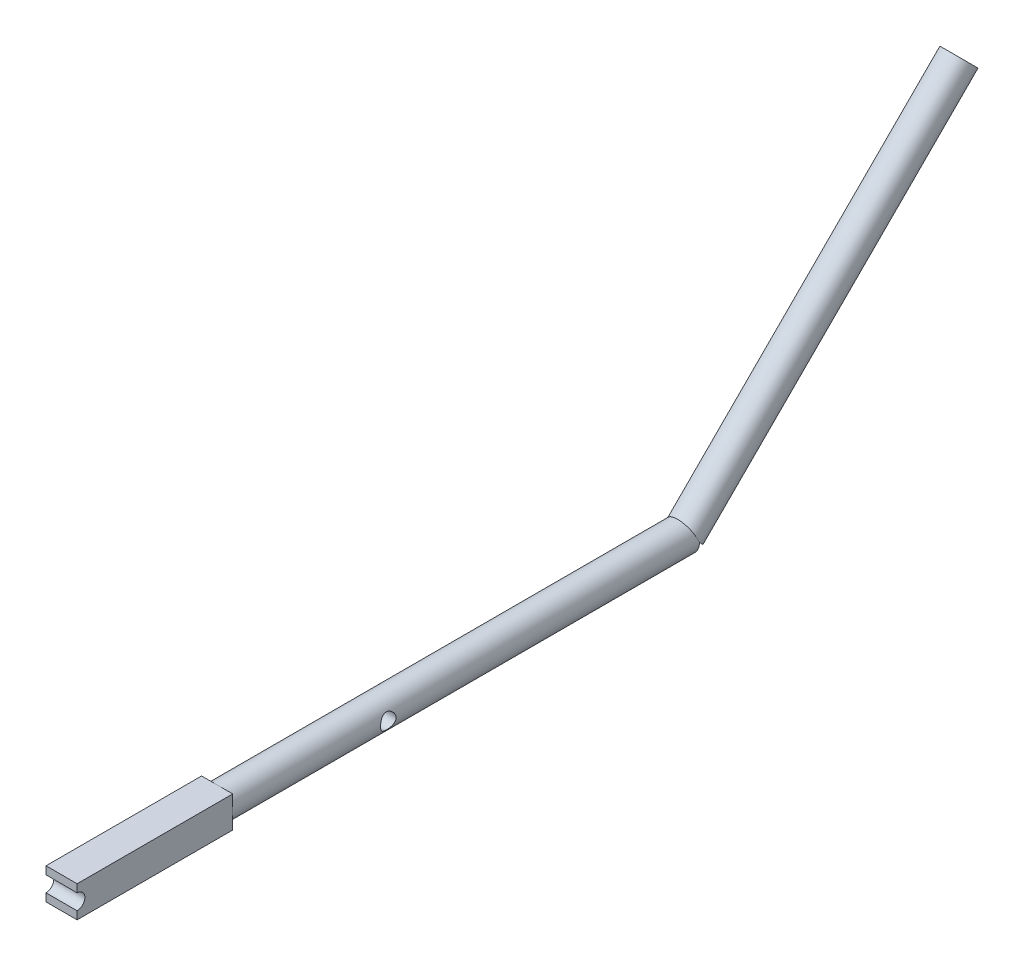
ISO-10303-21;
HEADER;
FILE_DESCRIPTION(('STEP AP214'),'2;1');
FILE_NAME('part.step','',(''),(''),'','','');
FILE_SCHEMA(('AUTOMOTIVE_DESIGN { 1 0 10303 214 1 1 1 1 }'));
ENDSEC;
DATA;
#1=APPLICATION_CONTEXT('core data for automotive mechanical design processes');
#2=APPLICATION_PROTOCOL_DEFINITION('international standard','automotive_design',2000,#1);
#3=PRODUCT_CONTEXT('',#1,'mechanical');
#4=PRODUCT('Part','Part','',(#3));
#5=PRODUCT_RELATED_PRODUCT_CATEGORY('part','',(#4));
#6=PRODUCT_DEFINITION_FORMATION('','',#4);
#7=PRODUCT_DEFINITION_CONTEXT('part definition',#1,'design');
#8=PRODUCT_DEFINITION('design','',#6,#7);
#9=PRODUCT_DEFINITION_SHAPE('','',#8);
#10=(LENGTH_UNIT() NAMED_UNIT(*) SI_UNIT(.MILLI.,.METRE.));
#11=(NAMED_UNIT(*) PLANE_ANGLE_UNIT() SI_UNIT($,.RADIAN.));
#12=(NAMED_UNIT(*) SI_UNIT($,.STERADIAN.) SOLID_ANGLE_UNIT());
#13=UNCERTAINTY_MEASURE_WITH_UNIT(LENGTH_MEASURE(1.E-05),#10,'distance_accuracy_value','');
#14=(GEOMETRIC_REPRESENTATION_CONTEXT(3) GLOBAL_UNCERTAINTY_ASSIGNED_CONTEXT((#13)) GLOBAL_UNIT_ASSIGNED_CONTEXT((#10,
#11,#12)) REPRESENTATION_CONTEXT('',''));
#15=CARTESIAN_POINT('',(0.,0.,0.));
#16=DIRECTION('',(0.,0.,1.));
#17=DIRECTION('',(1.,0.,0.));
#18=AXIS2_PLACEMENT_3D('',#15,#16,#17);
#19=CARTESIAN_POINT('',(0.,0.,400.));
#20=DIRECTION('',(0.,0.,1.));
#21=DIRECTION('',(1.,0.,0.));
#22=AXIS2_PLACEMENT_3D('',#19,#20,#21);
#23=PLANE('',#22);
#24=DIRECTION('',(1.,0.,0.));
#25=VECTOR('',#24,1.);
#26=CARTESIAN_POINT('',(-48.2842712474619,-9.99999999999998,400.));
#27=LINE('',#26,#25);
#28=CARTESIAN_POINT('',(-20.,-9.99999999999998,400.));
#29=VERTEX_POINT('',#28);
#30=CARTESIAN_POINT('',(20.,-9.99999999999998,400.));
#31=VERTEX_POINT('',#30);
#32=EDGE_CURVE('E100',#29,#31,#27,.T.);
#33=ORIENTED_EDGE('',*,*,#32,.F.);
#34=DIRECTION('',(0.,-1.,0.));
#35=VECTOR('',#34,1.);
#36=CARTESIAN_POINT('',(-20.,-20.1185560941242,400.));
#37=LINE('',#36,#35);
#38=CARTESIAN_POINT('',(-20.,-20.1185560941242,400.));
#39=VERTEX_POINT('',#38);
#40=EDGE_CURVE('E326',#29,#39,#37,.T.);
#41=ORIENTED_EDGE('',*,*,#40,.T.);
#42=DIRECTION('',(1.,0.,0.));
#43=VECTOR('',#42,1.);
#44=CARTESIAN_POINT('',(20.,-20.1185560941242,400.));
#45=LINE('',#44,#43);
#46=CARTESIAN_POINT('',(20.,-20.1185560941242,400.));
#47=VERTEX_POINT('',#46);
#48=EDGE_CURVE('E118',#39,#47,#45,.T.);
#49=ORIENTED_EDGE('',*,*,#48,.T.);
#50=DIRECTION('',(0.,1.,0.));
#51=VECTOR('',#50,1.);
#52=CARTESIAN_POINT('',(20.,-20.1185560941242,400.));
#53=LINE('',#52,#51);
#54=EDGE_CURVE('E112',#47,#31,#53,.T.);
#55=ORIENTED_EDGE('',*,*,#54,.T.);
#56=EDGE_LOOP('',(#33,#41,#49,#55));
#57=FACE_BOUND('',#56,.T.);
#58=ADVANCED_FACE('F33',(#57),#23,.T.);
#59=CARTESIAN_POINT('',(0.,0.,-400.));
#60=DIRECTION('',(0.,0.,1.));
#61=DIRECTION('',(1.,0.,0.));
#62=AXIS2_PLACEMENT_3D('',#59,#60,#61);
#63=CYLINDRICAL_SURFACE('',#62,20.);
#64=CARTESIAN_POINT('',(-20.,0.,-10.));
#65=CARTESIAN_POINT('',(-19.9999992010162,-0.26297774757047,-9.99999913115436));
#66=CARTESIAN_POINT('',(-19.9948010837,-0.525973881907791,-9.98961448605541));
#67=CARTESIAN_POINT('',(-19.9741395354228,-1.05002923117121,-9.94819417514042));
#68=CARTESIAN_POINT('',(-19.9586716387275,-1.31108755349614,-9.91714952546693));
#69=CARTESIAN_POINT('',(-19.9178362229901,-1.82963226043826,-9.83470808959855));
#70=CARTESIAN_POINT('',(-19.8924520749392,-2.08711188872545,-9.7832771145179));
#71=CARTESIAN_POINT('',(-19.8324363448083,-2.59618182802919,-9.6606617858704));
#72=CARTESIAN_POINT('',(-19.7978056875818,-2.84777272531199,-9.58947940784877));
#73=CARTESIAN_POINT('',(-19.720303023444,-3.34246836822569,-9.42843099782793));
#74=CARTESIAN_POINT('',(-19.6774637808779,-3.58560245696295,-9.33863913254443));
#75=CARTESIAN_POINT('',(-19.5844658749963,-4.06298432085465,-9.14105567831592));
#76=CARTESIAN_POINT('',(-19.5343070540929,-4.29723190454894,-9.03326370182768));
#77=CARTESIAN_POINT('',(-19.4278257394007,-4.75551398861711,-8.80063076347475));
#78=CARTESIAN_POINT('',(-19.371505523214,-4.97955221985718,-8.67579609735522));
#79=CARTESIAN_POINT('',(-19.2538936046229,-5.41653080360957,-8.40991307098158));
#80=CARTESIAN_POINT('',(-19.1925999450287,-5.62946673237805,-8.2688583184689));
#81=CARTESIAN_POINT('',(-19.0625536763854,-6.0557115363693,-7.96249543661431));
#82=CARTESIAN_POINT('',(-18.9935741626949,-6.2682689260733,-7.7962377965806));
#83=CARTESIAN_POINT('',(-18.8531326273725,-6.67880739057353,-7.4475548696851));
#84=CARTESIAN_POINT('',(-18.7816704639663,-6.87678763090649,-7.26512865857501));
#85=CARTESIAN_POINT('',(-18.6379106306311,-7.25738906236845,-6.88496142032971));
#86=CARTESIAN_POINT('',(-18.5656124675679,-7.44000060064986,-6.68721091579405));
#87=CARTESIAN_POINT('',(-18.4219676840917,-7.7888836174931,-6.27739804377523));
#88=CARTESIAN_POINT('',(-18.3506212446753,-7.95515202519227,-6.06533299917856));
#89=CARTESIAN_POINT('',(-18.2052535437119,-8.2827111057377,-5.61080680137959));
#90=CARTESIAN_POINT('',(-18.1314567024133,-8.44260565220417,-5.3672646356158));
#91=CARTESIAN_POINT('',(-17.9894590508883,-8.74109142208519,-4.8660415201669));
#92=CARTESIAN_POINT('',(-17.9212558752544,-8.87969167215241,-4.60836662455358));
#93=CARTESIAN_POINT('',(-17.7927881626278,-9.13438777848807,-4.08030079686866));
#94=CARTESIAN_POINT('',(-17.7325212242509,-9.25049044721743,-3.8099137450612));
#95=CARTESIAN_POINT('',(-17.6222099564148,-9.45894522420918,-3.25811404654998));
#96=CARTESIAN_POINT('',(-17.5721644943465,-9.55129996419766,-2.97670262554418));
#97=CARTESIAN_POINT('',(-17.4870229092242,-9.70625458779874,-2.42208495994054));
#98=CARTESIAN_POINT('',(-17.4512120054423,-9.77030307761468,-2.14939374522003));
#99=CARTESIAN_POINT('',(-17.3919377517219,-9.87543221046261,-1.59828353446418));
#100=CARTESIAN_POINT('',(-17.368473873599,-9.91651383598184,-1.31986478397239));
#101=CARTESIAN_POINT('',(-17.3349233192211,-9.97504777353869,-0.7599854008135));
#102=CARTESIAN_POINT('',(-17.3248253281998,-9.99252007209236,-0.478527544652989));
#103=CARTESIAN_POINT('',(-17.3184259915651,-10.0036080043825,0.0850025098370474));
#104=CARTESIAN_POINT('',(-17.3221233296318,-9.99722591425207,0.367074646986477));
#105=CARTESIAN_POINT('',(-17.3418743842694,-9.96291632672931,0.895404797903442));
#106=CARTESIAN_POINT('',(-17.3563927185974,-9.93766509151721,1.14190017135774));
#107=CARTESIAN_POINT('',(-17.3954780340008,-9.8690882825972,1.63163922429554));
#108=CARTESIAN_POINT('',(-17.4200483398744,-9.82575672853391,1.8748818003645));
#109=CARTESIAN_POINT('',(-17.4784283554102,-9.72152759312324,2.35639172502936));
#110=CARTESIAN_POINT('',(-17.5122368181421,-9.66063238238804,2.59465974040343));
#111=CARTESIAN_POINT('',(-17.5880654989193,-9.5218798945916,3.06495356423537));
#112=CARTESIAN_POINT('',(-17.6300889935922,-9.44401584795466,3.29697683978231));
#113=CARTESIAN_POINT('',(-17.7221768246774,-9.27007793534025,3.75871059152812));
#114=CARTESIAN_POINT('',(-17.7724029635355,-9.17362860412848,3.98824705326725));
#115=CARTESIAN_POINT('',(-17.878810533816,-8.96447979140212,4.43843816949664));
#116=CARTESIAN_POINT('',(-17.9349939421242,-8.85177491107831,4.65908984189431));
#117=CARTESIAN_POINT('',(-18.0518884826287,-8.61087933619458,5.09056177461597));
#118=CARTESIAN_POINT('',(-18.1126004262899,-8.48268586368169,5.30138026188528));
#119=CARTESIAN_POINT('',(-18.2371218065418,-8.21155546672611,5.71235236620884));
#120=CARTESIAN_POINT('',(-18.3009314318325,-8.06861764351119,5.9125053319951));
#121=CARTESIAN_POINT('',(-18.4384710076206,-7.74962298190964,6.32613167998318));
#122=CARTESIAN_POINT('',(-18.5124312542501,-7.57166567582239,6.53806610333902));
#123=CARTESIAN_POINT('',(-18.6605447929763,-7.19890817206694,6.9463748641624));
#124=CARTESIAN_POINT('',(-18.7346980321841,-7.00411219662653,7.14275307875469));
#125=CARTESIAN_POINT('',(-18.8814062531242,-6.5984132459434,7.51914658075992));
#126=CARTESIAN_POINT('',(-18.9539598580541,-6.38749704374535,7.69914815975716));
#127=CARTESIAN_POINT('',(-19.0955673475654,-5.95079617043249,8.04145286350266));
#128=CARTESIAN_POINT('',(-19.164622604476,-5.72501741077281,8.20376295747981));
#129=CARTESIAN_POINT('',(-19.3006480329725,-5.24872768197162,8.51679586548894));
#130=CARTESIAN_POINT('',(-19.3673693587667,-4.99755374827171,8.66662084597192));
#131=CARTESIAN_POINT('',(-19.4932401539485,-4.48152997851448,8.94436923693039));
#132=CARTESIAN_POINT('',(-19.5523892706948,-4.21667950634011,9.07229162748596));
#133=CARTESIAN_POINT('',(-19.6613492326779,-3.67526022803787,9.30479430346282));
#134=CARTESIAN_POINT('',(-19.7111660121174,-3.39869900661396,9.40938943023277));
#135=CARTESIAN_POINT('',(-19.7999810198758,-2.83582264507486,9.59405077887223));
#136=CARTESIAN_POINT('',(-19.8389804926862,-2.54950863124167,9.6741198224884));
#137=CARTESIAN_POINT('',(-19.9021913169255,-1.9936008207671,9.80306586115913));
#138=CARTESIAN_POINT('',(-19.9273600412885,-1.72458658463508,9.85397724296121));
#139=CARTESIAN_POINT('',(-19.9668602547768,-1.18250594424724,9.93361515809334));
#140=CARTESIAN_POINT('',(-19.9811923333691,-0.909439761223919,9.96234289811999));
#141=CARTESIAN_POINT('',(-19.9986076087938,-0.361621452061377,9.99722632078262));
#142=CARTESIAN_POINT('',(-20.0016953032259,-0.0868700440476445,10.0033910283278));
#143=CARTESIAN_POINT('',(-19.996544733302,0.462095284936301,9.99308881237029));
#144=CARTESIAN_POINT('',(-19.9883069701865,0.736309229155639,9.97662289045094));
#145=CARTESIAN_POINT('',(-19.9618171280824,1.26069578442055,9.92343793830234));
#146=CARTESIAN_POINT('',(-19.9443921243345,1.51108216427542,9.88839042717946));
#147=CARTESIAN_POINT('',(-19.9005341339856,2.0077033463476,9.79963000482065));
#148=CARTESIAN_POINT('',(-19.8741017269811,2.25393841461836,9.74591829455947));
#149=CARTESIAN_POINT('',(-19.812845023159,2.7406844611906,9.62038600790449));
#150=CARTESIAN_POINT('',(-19.7780202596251,2.98119512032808,9.54856442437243));
#151=CARTESIAN_POINT('',(-19.7007681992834,3.4550508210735,9.38750534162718));
#152=CARTESIAN_POINT('',(-19.6583405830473,3.68839556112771,9.29826711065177));
#153=CARTESIAN_POINT('',(-19.5655046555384,4.15316088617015,9.1003752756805));
#154=CARTESIAN_POINT('',(-19.5149041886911,4.38433936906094,8.99124296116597));
#155=CARTESIAN_POINT('',(-19.4077573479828,4.83663774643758,8.75625210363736));
#156=CARTESIAN_POINT('',(-19.3512088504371,5.05775400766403,8.63038758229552));
#157=CARTESIAN_POINT('',(-19.1744474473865,5.70436813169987,8.22905651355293));
#158=CARTESIAN_POINT('',(-19.0470672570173,6.11337858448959,7.92974633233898));
#159=CARTESIAN_POINT('',(-18.7707873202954,6.91779518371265,7.24229945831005));
#160=CARTESIAN_POINT('',(-18.6210027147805,7.30792110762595,6.84832629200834));
#161=CARTESIAN_POINT('',(-18.3999640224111,7.84082560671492,6.21273944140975));
#162=CARTESIAN_POINT('',(-18.3268393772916,8.00984942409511,5.99326478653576));
#163=CARTESIAN_POINT('',(-18.183737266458,8.32960568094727,5.54026055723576));
#164=CARTESIAN_POINT('',(-18.1137602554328,8.4803354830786,5.30672896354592));
#165=CARTESIAN_POINT('',(-17.9757225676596,8.76928163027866,4.81507400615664));
#166=CARTESIAN_POINT('',(-17.9079221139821,8.90652817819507,4.55630669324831));
#167=CARTESIAN_POINT('',(-17.7804404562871,9.15837639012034,4.02618845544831));
#168=CARTESIAN_POINT('',(-17.7207553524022,9.27298894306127,3.75484365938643));
#169=CARTESIAN_POINT('',(-17.6118078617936,9.47827705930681,3.20145013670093));
#170=CARTESIAN_POINT('',(-17.5625371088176,9.56897185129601,2.91941021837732));
#171=CARTESIAN_POINT('',(-17.4764560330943,9.72530086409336,2.34661678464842));
#172=CARTESIAN_POINT('',(-17.4396437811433,9.79093896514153,2.0558646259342));
#173=CARTESIAN_POINT('',(-17.3830260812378,9.89107565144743,1.49647520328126));
#174=CARTESIAN_POINT('',(-17.3619273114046,9.92795857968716,1.22839424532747));
#175=CARTESIAN_POINT('',(-17.332136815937,9.97987692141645,0.689439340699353));
#176=CARTESIAN_POINT('',(-17.3234442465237,9.99491382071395,0.418565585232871));
#177=CARTESIAN_POINT('',(-17.3188284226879,10.0029096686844,-0.123513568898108));
#178=CARTESIAN_POINT('',(-17.3229004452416,9.9958767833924,-0.394718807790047));
#179=CARTESIAN_POINT('',(-17.3436339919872,9.95985898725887,-0.935172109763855));
#180=CARTESIAN_POINT('',(-17.3602950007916,9.93087497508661,-1.20442025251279));
#181=CARTESIAN_POINT('',(-17.4033551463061,9.85519722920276,-1.71311444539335));
#182=CARTESIAN_POINT('',(-17.4286705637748,9.81046230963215,-1.95294800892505));
#183=CARTESIAN_POINT('',(-17.4882355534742,9.70388285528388,-2.42772919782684));
#184=CARTESIAN_POINT('',(-17.5224880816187,9.6420326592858,-2.66267517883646));
#185=CARTESIAN_POINT('',(-17.5988921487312,9.50186064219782,-3.12622361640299));
#186=CARTESIAN_POINT('',(-17.6410423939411,9.42354151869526,-3.35482710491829));
#187=CARTESIAN_POINT('',(-17.7320944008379,9.25107208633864,-3.80469848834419));
#188=CARTESIAN_POINT('',(-17.7809991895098,9.15691467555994,-4.02596303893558));
#189=CARTESIAN_POINT('',(-17.8877520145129,8.94668289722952,-4.47462589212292));
#190=CARTESIAN_POINT('',(-17.9459794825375,8.82956366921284,-4.70144417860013));
#191=CARTESIAN_POINT('',(-18.067122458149,8.57895403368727,-5.14454543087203));
#192=CARTESIAN_POINT('',(-18.130038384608,8.44546216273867,-5.36082745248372));
#193=CARTESIAN_POINT('',(-18.2590224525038,8.16285657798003,-5.78205137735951));
#194=CARTESIAN_POINT('',(-18.3250916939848,8.0137373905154,-5.98698926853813));
#195=CARTESIAN_POINT('',(-18.4588439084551,7.70065351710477,-6.38466859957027));
#196=CARTESIAN_POINT('',(-18.5265271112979,7.53668670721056,-6.57740828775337));
#197=CARTESIAN_POINT('',(-18.6702735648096,7.17380336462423,-6.9725890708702));
#198=CARTESIAN_POINT('',(-18.746353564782,6.97306234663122,-7.17335317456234));
#199=CARTESIAN_POINT('',(-18.8966226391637,6.55492133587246,-7.55735140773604));
#200=CARTESIAN_POINT('',(-18.9708122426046,6.33752607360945,-7.74059048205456));
#201=CARTESIAN_POINT('',(-19.1154396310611,5.88693376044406,-8.08857822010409));
#202=CARTESIAN_POINT('',(-19.1858744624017,5.65372458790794,-8.25331243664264));
#203=CARTESIAN_POINT('',(-19.3210638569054,5.1728954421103,-8.56287912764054));
#204=CARTESIAN_POINT('',(-19.3858187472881,4.92527630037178,-8.70771274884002));
#205=CARTESIAN_POINT('',(-19.5083417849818,4.41518835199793,-8.97718827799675));
#206=CARTESIAN_POINT('',(-19.5660555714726,4.15262447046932,-9.10167533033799));
#207=CARTESIAN_POINT('',(-19.6722841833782,3.61607511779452,-9.32784736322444));
#208=CARTESIAN_POINT('',(-19.7208001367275,3.34209105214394,-9.42953513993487));
#209=CARTESIAN_POINT('',(-19.8070877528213,2.78539452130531,-9.60868749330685));
#210=CARTESIAN_POINT('',(-19.8448847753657,2.50270444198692,-9.68620928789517));
#211=CARTESIAN_POINT('',(-19.908692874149,1.93047321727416,-9.81627609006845));
#212=CARTESIAN_POINT('',(-19.9347111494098,1.64093637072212,-9.86883635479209));
#213=CARTESIAN_POINT('',(-19.9695276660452,1.12608352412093,-9.93894890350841));
#214=CARTESIAN_POINT('',(-19.9809348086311,0.901651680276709,-9.96182346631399));
#215=CARTESIAN_POINT('',(-19.9961714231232,0.451484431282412,-9.99234959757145));
#216=CARTESIAN_POINT('',(-20.0000006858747,0.225748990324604,-10.0000007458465));
#217=CARTESIAN_POINT('',(-20.,0.,-10.));
#218=B_SPLINE_CURVE_WITH_KNOTS('',3,(#64,#65,#66,#67,#68,#69,#70,#71,#72,#73,#74,#75,#76,#77,
#78,#79,#80,#81,#82,#83,#84,#85,#86,#87,#88,#89,#90,#91,#92,#93,#94,#95,#96,#97,#98,#99,#100,
#101,#102,#103,#104,#105,#106,#107,#108,#109,#110,#111,#112,#113,#114,#115,#116,#117,#118,#119,
#120,#121,#122,#123,#124,#125,#126,#127,#128,#129,#130,#131,#132,#133,#134,#135,#136,#137,#138,
#139,#140,#141,#142,#143,#144,#145,#146,#147,#148,#149,#150,#151,#152,#153,#154,#155,#156,#157,
#158,#159,#160,#161,#162,#163,#164,#165,#166,#167,#168,#169,#170,#171,#172,#173,#174,#175,#176,
#177,#178,#179,#180,#181,#182,#183,#184,#185,#186,#187,#188,#189,#190,#191,#192,#193,#194,#195,
#196,#197,#198,#199,#200,#201,#202,#203,#204,#205,#206,#207,#208,#209,#210,#211,#212,#213,#214,
#215,#216,#217),.UNSPECIFIED.,.T.,.F.,(4,2,2,2,2,2,2,2,2,2,2,2,2,2,2,2,2,2,2,2,2,2,2,2,2,2,2,2,
2,2,2,2,2,2,2,2,2,2,2,2,2,2,2,2,2,2,2,2,2,2,2,2,2,2,2,2,2,2,2,2,2,2,2,2,2,2,2,2,2,2,2,2,2,2,2,2,
4),(0.,0.788710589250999,1.57776436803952,2.36814706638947,3.15845073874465,3.94566328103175,
4.73289277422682,5.51983223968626,6.30708290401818,7.14179607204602,7.9765569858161,
8.81183834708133,9.64727635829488,10.5477781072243,11.447897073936,12.3477430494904,
13.2474892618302,14.0934532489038,14.9393810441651,15.7845922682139,16.6297228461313,
17.3734776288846,18.1174786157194,18.8613792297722,19.6055771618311,20.3667813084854,
21.1282388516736,21.889833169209,22.6514739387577,23.509891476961,24.3680943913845,
25.2270091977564,26.0855844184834,26.9843425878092,27.8831425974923,28.781369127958,
29.6794922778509,30.5032194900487,31.3269018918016,32.1502547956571,32.9735712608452,
33.7329722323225,34.4923243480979,35.2517187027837,36.0111449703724,36.7921013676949,
37.5733375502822,39.1349970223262,40.850013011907,41.7087612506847,42.5676331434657,
43.4684238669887,44.3687801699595,45.2684104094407,46.167901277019,46.9810473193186,
47.7941380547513,48.6069279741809,49.4196846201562,50.1547113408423,50.889981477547,
51.6251312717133,52.3606115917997,53.1452977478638,53.9300540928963,54.7150862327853,
55.5002308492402,56.3809909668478,57.2615018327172,58.1426954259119,59.0238382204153,
59.9114030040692,60.7988588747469,61.6841972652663,62.5689938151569,63.2460309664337,
63.9230868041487),.UNSPECIFIED.);
#219=CARTESIAN_POINT('',(-20.,0.,-10.));
#220=VERTEX_POINT('',#219);
#221=EDGE_CURVE('E11',#220,#220,#218,.T.);
#222=ORIENTED_EDGE('',*,*,#221,.F.);
#223=EDGE_LOOP('',(#222));
#224=FACE_BOUND('',#223,.T.);
#225=CARTESIAN_POINT('',(20.,0.,-10.));
#226=CARTESIAN_POINT('',(19.9999992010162,0.26297774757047,-9.99999913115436));
#227=CARTESIAN_POINT('',(19.9948010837,0.525973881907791,-9.98961448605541));
#228=CARTESIAN_POINT('',(19.9741395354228,1.05002923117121,-9.94819417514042));
#229=CARTESIAN_POINT('',(19.9586716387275,1.31108755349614,-9.91714952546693));
#230=CARTESIAN_POINT('',(19.9178362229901,1.82963226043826,-9.83470808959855));
#231=CARTESIAN_POINT('',(19.8924520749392,2.08711188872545,-9.7832771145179));
#232=CARTESIAN_POINT('',(19.8324363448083,2.59618182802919,-9.6606617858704));
#233=CARTESIAN_POINT('',(19.7978056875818,2.84777272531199,-9.58947940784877));
#234=CARTESIAN_POINT('',(19.720303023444,3.34246836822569,-9.42843099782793));
#235=CARTESIAN_POINT('',(19.6774637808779,3.58560245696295,-9.33863913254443));
#236=CARTESIAN_POINT('',(19.5844658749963,4.06298432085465,-9.14105567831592));
#237=CARTESIAN_POINT('',(19.5343070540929,4.29723190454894,-9.03326370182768));
#238=CARTESIAN_POINT('',(19.4278257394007,4.75551398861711,-8.80063076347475));
#239=CARTESIAN_POINT('',(19.371505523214,4.97955221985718,-8.67579609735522));
#240=CARTESIAN_POINT('',(19.2538936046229,5.41653080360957,-8.40991307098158));
#241=CARTESIAN_POINT('',(19.1925999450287,5.62946673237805,-8.2688583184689));
#242=CARTESIAN_POINT('',(19.0625536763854,6.0557115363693,-7.96249543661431));
#243=CARTESIAN_POINT('',(18.9935741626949,6.2682689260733,-7.7962377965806));
#244=CARTESIAN_POINT('',(18.8531326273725,6.67880739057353,-7.4475548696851));
#245=CARTESIAN_POINT('',(18.7816704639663,6.87678763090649,-7.26512865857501));
#246=CARTESIAN_POINT('',(18.6379106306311,7.25738906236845,-6.88496142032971));
#247=CARTESIAN_POINT('',(18.5656124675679,7.44000060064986,-6.68721091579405));
#248=CARTESIAN_POINT('',(18.4219676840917,7.7888836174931,-6.27739804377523));
#249=CARTESIAN_POINT('',(18.3506212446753,7.95515202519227,-6.06533299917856));
#250=CARTESIAN_POINT('',(18.2052535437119,8.2827111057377,-5.61080680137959));
#251=CARTESIAN_POINT('',(18.1314567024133,8.44260565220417,-5.3672646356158));
#252=CARTESIAN_POINT('',(17.9894590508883,8.74109142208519,-4.8660415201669));
#253=CARTESIAN_POINT('',(17.9212558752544,8.87969167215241,-4.60836662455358));
#254=CARTESIAN_POINT('',(17.7927881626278,9.13438777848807,-4.08030079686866));
#255=CARTESIAN_POINT('',(17.7325212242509,9.25049044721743,-3.8099137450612));
#256=CARTESIAN_POINT('',(17.6222099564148,9.45894522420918,-3.25811404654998));
#257=CARTESIAN_POINT('',(17.5721644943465,9.55129996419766,-2.97670262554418));
#258=CARTESIAN_POINT('',(17.4870229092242,9.70625458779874,-2.42208495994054));
#259=CARTESIAN_POINT('',(17.4512120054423,9.77030307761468,-2.14939374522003));
#260=CARTESIAN_POINT('',(17.3919377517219,9.87543221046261,-1.59828353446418));
#261=CARTESIAN_POINT('',(17.368473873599,9.91651383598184,-1.31986478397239));
#262=CARTESIAN_POINT('',(17.3349233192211,9.97504777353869,-0.7599854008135));
#263=CARTESIAN_POINT('',(17.3248253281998,9.99252007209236,-0.478527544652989));
#264=CARTESIAN_POINT('',(17.3184259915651,10.0036080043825,0.0850025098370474));
#265=CARTESIAN_POINT('',(17.3221233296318,9.99722591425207,0.367074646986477));
#266=CARTESIAN_POINT('',(17.3418743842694,9.96291632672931,0.895404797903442));
#267=CARTESIAN_POINT('',(17.3563927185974,9.93766509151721,1.14190017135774));
#268=CARTESIAN_POINT('',(17.3954780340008,9.8690882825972,1.63163922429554));
#269=CARTESIAN_POINT('',(17.4200483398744,9.82575672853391,1.8748818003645));
#270=CARTESIAN_POINT('',(17.4784283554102,9.72152759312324,2.35639172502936));
#271=CARTESIAN_POINT('',(17.5122368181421,9.66063238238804,2.59465974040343));
#272=CARTESIAN_POINT('',(17.5880654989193,9.5218798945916,3.06495356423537));
#273=CARTESIAN_POINT('',(17.6300889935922,9.44401584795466,3.29697683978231));
#274=CARTESIAN_POINT('',(17.7221768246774,9.27007793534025,3.75871059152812));
#275=CARTESIAN_POINT('',(17.7724029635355,9.17362860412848,3.98824705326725));
#276=CARTESIAN_POINT('',(17.878810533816,8.96447979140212,4.43843816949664));
#277=CARTESIAN_POINT('',(17.9349939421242,8.85177491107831,4.65908984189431));
#278=CARTESIAN_POINT('',(18.0518884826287,8.61087933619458,5.09056177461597));
#279=CARTESIAN_POINT('',(18.1126004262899,8.48268586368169,5.30138026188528));
#280=CARTESIAN_POINT('',(18.2371218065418,8.21155546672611,5.71235236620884));
#281=CARTESIAN_POINT('',(18.3009314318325,8.06861764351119,5.9125053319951));
#282=CARTESIAN_POINT('',(18.4384710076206,7.74962298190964,6.32613167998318));
#283=CARTESIAN_POINT('',(18.5124312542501,7.57166567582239,6.53806610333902));
#284=CARTESIAN_POINT('',(18.6605447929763,7.19890817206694,6.9463748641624));
#285=CARTESIAN_POINT('',(18.7346980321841,7.00411219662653,7.14275307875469));
#286=CARTESIAN_POINT('',(18.8814062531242,6.5984132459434,7.51914658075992));
#287=CARTESIAN_POINT('',(18.9539598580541,6.38749704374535,7.69914815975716));
#288=CARTESIAN_POINT('',(19.0955673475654,5.95079617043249,8.04145286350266));
#289=CARTESIAN_POINT('',(19.164622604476,5.72501741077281,8.20376295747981));
#290=CARTESIAN_POINT('',(19.3006480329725,5.24872768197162,8.51679586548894));
#291=CARTESIAN_POINT('',(19.3673693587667,4.99755374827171,8.66662084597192));
#292=CARTESIAN_POINT('',(19.4932401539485,4.48152997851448,8.94436923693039));
#293=CARTESIAN_POINT('',(19.5523892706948,4.21667950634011,9.07229162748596));
#294=CARTESIAN_POINT('',(19.6613492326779,3.67526022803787,9.30479430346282));
#295=CARTESIAN_POINT('',(19.7111660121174,3.39869900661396,9.40938943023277));
#296=CARTESIAN_POINT('',(19.7999810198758,2.83582264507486,9.59405077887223));
#297=CARTESIAN_POINT('',(19.8389804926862,2.54950863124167,9.6741198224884));
#298=CARTESIAN_POINT('',(19.9021913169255,1.9936008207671,9.80306586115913));
#299=CARTESIAN_POINT('',(19.9273600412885,1.72458658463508,9.85397724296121));
#300=CARTESIAN_POINT('',(19.9668602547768,1.18250594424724,9.93361515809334));
#301=CARTESIAN_POINT('',(19.9811923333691,0.909439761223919,9.96234289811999));
#302=CARTESIAN_POINT('',(19.9986076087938,0.361621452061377,9.99722632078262));
#303=CARTESIAN_POINT('',(20.0016953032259,0.0868700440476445,10.0033910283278));
#304=CARTESIAN_POINT('',(19.996544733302,-0.462095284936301,9.99308881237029));
#305=CARTESIAN_POINT('',(19.9883069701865,-0.736309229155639,9.97662289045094));
#306=CARTESIAN_POINT('',(19.9618171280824,-1.26069578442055,9.92343793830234));
#307=CARTESIAN_POINT('',(19.9443921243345,-1.51108216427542,9.88839042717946));
#308=CARTESIAN_POINT('',(19.9005341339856,-2.0077033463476,9.79963000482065));
#309=CARTESIAN_POINT('',(19.8741017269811,-2.25393841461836,9.74591829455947));
#310=CARTESIAN_POINT('',(19.812845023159,-2.7406844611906,9.62038600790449));
#311=CARTESIAN_POINT('',(19.7780202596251,-2.98119512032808,9.54856442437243));
#312=CARTESIAN_POINT('',(19.7007681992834,-3.4550508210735,9.38750534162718));
#313=CARTESIAN_POINT('',(19.6583405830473,-3.68839556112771,9.29826711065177));
#314=CARTESIAN_POINT('',(19.5655046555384,-4.15316088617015,9.1003752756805));
#315=CARTESIAN_POINT('',(19.5149041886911,-4.38433936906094,8.99124296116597));
#316=CARTESIAN_POINT('',(19.4077573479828,-4.83663774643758,8.75625210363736));
#317=CARTESIAN_POINT('',(19.3512088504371,-5.05775400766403,8.63038758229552));
#318=CARTESIAN_POINT('',(19.1744474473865,-5.70436813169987,8.22905651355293));
#319=CARTESIAN_POINT('',(19.0470672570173,-6.11337858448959,7.92974633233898));
#320=CARTESIAN_POINT('',(18.7707873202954,-6.91779518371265,7.24229945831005));
#321=CARTESIAN_POINT('',(18.6210027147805,-7.30792110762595,6.84832629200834));
#322=CARTESIAN_POINT('',(18.3999640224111,-7.84082560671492,6.21273944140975));
#323=CARTESIAN_POINT('',(18.3268393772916,-8.00984942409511,5.99326478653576));
#324=CARTESIAN_POINT('',(18.183737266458,-8.32960568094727,5.54026055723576));
#325=CARTESIAN_POINT('',(18.1137602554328,-8.4803354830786,5.30672896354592));
#326=CARTESIAN_POINT('',(17.9757225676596,-8.76928163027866,4.81507400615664));
#327=CARTESIAN_POINT('',(17.9079221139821,-8.90652817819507,4.55630669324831));
#328=CARTESIAN_POINT('',(17.7804404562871,-9.15837639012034,4.02618845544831));
#329=CARTESIAN_POINT('',(17.7207553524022,-9.27298894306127,3.75484365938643));
#330=CARTESIAN_POINT('',(17.6118078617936,-9.47827705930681,3.20145013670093));
#331=CARTESIAN_POINT('',(17.5625371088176,-9.56897185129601,2.91941021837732));
#332=CARTESIAN_POINT('',(17.4764560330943,-9.72530086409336,2.34661678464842));
#333=CARTESIAN_POINT('',(17.4396437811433,-9.79093896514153,2.0558646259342));
#334=CARTESIAN_POINT('',(17.3830260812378,-9.89107565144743,1.49647520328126));
#335=CARTESIAN_POINT('',(17.3619273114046,-9.92795857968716,1.22839424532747));
#336=CARTESIAN_POINT('',(17.332136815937,-9.97987692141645,0.689439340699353));
#337=CARTESIAN_POINT('',(17.3234442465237,-9.99491382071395,0.418565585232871));
#338=CARTESIAN_POINT('',(17.3188284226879,-10.0029096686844,-0.123513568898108));
#339=CARTESIAN_POINT('',(17.3229004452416,-9.9958767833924,-0.394718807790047));
#340=CARTESIAN_POINT('',(17.3436339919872,-9.95985898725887,-0.935172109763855));
#341=CARTESIAN_POINT('',(17.3602950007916,-9.93087497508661,-1.20442025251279));
#342=CARTESIAN_POINT('',(17.4033551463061,-9.85519722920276,-1.71311444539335));
#343=CARTESIAN_POINT('',(17.4286705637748,-9.81046230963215,-1.95294800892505));
#344=CARTESIAN_POINT('',(17.4882355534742,-9.70388285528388,-2.42772919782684));
#345=CARTESIAN_POINT('',(17.5224880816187,-9.6420326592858,-2.66267517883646));
#346=CARTESIAN_POINT('',(17.5988921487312,-9.50186064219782,-3.12622361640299));
#347=CARTESIAN_POINT('',(17.6410423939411,-9.42354151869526,-3.35482710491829));
#348=CARTESIAN_POINT('',(17.7320944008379,-9.25107208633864,-3.80469848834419));
#349=CARTESIAN_POINT('',(17.7809991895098,-9.15691467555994,-4.02596303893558));
#350=CARTESIAN_POINT('',(17.8877520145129,-8.94668289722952,-4.47462589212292));
#351=CARTESIAN_POINT('',(17.9459794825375,-8.82956366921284,-4.70144417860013));
#352=CARTESIAN_POINT('',(18.067122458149,-8.57895403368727,-5.14454543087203));
#353=CARTESIAN_POINT('',(18.130038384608,-8.44546216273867,-5.36082745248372));
#354=CARTESIAN_POINT('',(18.2590224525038,-8.16285657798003,-5.78205137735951));
#355=CARTESIAN_POINT('',(18.3250916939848,-8.0137373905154,-5.98698926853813));
#356=CARTESIAN_POINT('',(18.4588439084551,-7.70065351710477,-6.38466859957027));
#357=CARTESIAN_POINT('',(18.5265271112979,-7.53668670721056,-6.57740828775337));
#358=CARTESIAN_POINT('',(18.6702735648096,-7.17380336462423,-6.9725890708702));
#359=CARTESIAN_POINT('',(18.746353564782,-6.97306234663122,-7.17335317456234));
#360=CARTESIAN_POINT('',(18.8966226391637,-6.55492133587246,-7.55735140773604));
#361=CARTESIAN_POINT('',(18.9708122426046,-6.33752607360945,-7.74059048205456));
#362=CARTESIAN_POINT('',(19.1154396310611,-5.88693376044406,-8.08857822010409));
#363=CARTESIAN_POINT('',(19.1858744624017,-5.65372458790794,-8.25331243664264));
#364=CARTESIAN_POINT('',(19.3210638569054,-5.1728954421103,-8.56287912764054));
#365=CARTESIAN_POINT('',(19.3858187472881,-4.92527630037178,-8.70771274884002));
#366=CARTESIAN_POINT('',(19.5083417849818,-4.41518835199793,-8.97718827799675));
#367=CARTESIAN_POINT('',(19.5660555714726,-4.15262447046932,-9.10167533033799));
#368=CARTESIAN_POINT('',(19.6722841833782,-3.61607511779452,-9.32784736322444));
#369=CARTESIAN_POINT('',(19.7208001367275,-3.34209105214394,-9.42953513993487));
#370=CARTESIAN_POINT('',(19.8070877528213,-2.78539452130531,-9.60868749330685));
#371=CARTESIAN_POINT('',(19.8448847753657,-2.50270444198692,-9.68620928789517));
#372=CARTESIAN_POINT('',(19.908692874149,-1.93047321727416,-9.81627609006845));
#373=CARTESIAN_POINT('',(19.9347111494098,-1.64093637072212,-9.86883635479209));
#374=CARTESIAN_POINT('',(19.9695276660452,-1.12608352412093,-9.93894890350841));
#375=CARTESIAN_POINT('',(19.9809348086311,-0.901651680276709,-9.96182346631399));
#376=CARTESIAN_POINT('',(19.9961714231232,-0.451484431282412,-9.99234959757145));
#377=CARTESIAN_POINT('',(20.0000006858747,-0.225748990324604,-10.0000007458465));
#378=CARTESIAN_POINT('',(20.,0.,-10.));
#379=B_SPLINE_CURVE_WITH_KNOTS('',3,(#225,#226,#227,#228,#229,#230,#231,#232,#233,#234,#235,
#236,#237,#238,#239,#240,#241,#242,#243,#244,#245,#246,#247,#248,#249,#250,#251,#252,#253,#254,
#255,#256,#257,#258,#259,#260,#261,#262,#263,#264,#265,#266,#267,#268,#269,#270,#271,#272,#273,
#274,#275,#276,#277,#278,#279,#280,#281,#282,#283,#284,#285,#286,#287,#288,#289,#290,#291,#292,
#293,#294,#295,#296,#297,#298,#299,#300,#301,#302,#303,#304,#305,#306,#307,#308,#309,#310,#311,
#312,#313,#314,#315,#316,#317,#318,#319,#320,#321,#322,#323,#324,#325,#326,#327,#328,#329,#330,
#331,#332,#333,#334,#335,#336,#337,#338,#339,#340,#341,#342,#343,#344,#345,#346,#347,#348,#349,
#350,#351,#352,#353,#354,#355,#356,#357,#358,#359,#360,#361,#362,#363,#364,#365,#366,#367,#368,
#369,#370,#371,#372,#373,#374,#375,#376,#377,#378),.UNSPECIFIED.,.T.,.F.,(4,2,2,2,2,2,2,2,2,2,2,
2,2,2,2,2,2,2,2,2,2,2,2,2,2,2,2,2,2,2,2,2,2,2,2,2,2,2,2,2,2,2,2,2,2,2,2,2,2,2,2,2,2,2,2,2,2,2,2,
2,2,2,2,2,2,2,2,2,2,2,2,2,2,2,2,2,4),(0.,0.788710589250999,1.57776436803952,2.36814706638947,
3.15845073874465,3.94566328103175,4.73289277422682,5.51983223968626,6.30708290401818,
7.14179607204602,7.9765569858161,8.81183834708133,9.64727635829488,10.5477781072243,
11.447897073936,12.3477430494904,13.2474892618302,14.0934532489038,14.9393810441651,
15.7845922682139,16.6297228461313,17.3734776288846,18.1174786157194,18.8613792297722,
19.6055771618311,20.3667813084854,21.1282388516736,21.889833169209,22.6514739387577,
23.509891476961,24.3680943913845,25.2270091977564,26.0855844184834,26.9843425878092,
27.8831425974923,28.781369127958,29.6794922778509,30.5032194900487,31.3269018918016,
32.1502547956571,32.9735712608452,33.7329722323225,34.4923243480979,35.2517187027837,
36.0111449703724,36.7921013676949,37.5733375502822,39.1349970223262,40.850013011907,
41.7087612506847,42.5676331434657,43.4684238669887,44.3687801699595,45.2684104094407,
46.167901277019,46.9810473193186,47.7941380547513,48.6069279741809,49.4196846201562,
50.1547113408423,50.889981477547,51.6251312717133,52.3606115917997,53.1452977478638,
53.9300540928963,54.7150862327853,55.5002308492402,56.3809909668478,57.2615018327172,
58.1426954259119,59.0238382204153,59.9114030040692,60.7988588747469,61.6841972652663,
62.5689938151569,63.2460309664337,63.9230868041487),.UNSPECIFIED.);
#380=CARTESIAN_POINT('',(20.,0.,-10.));
#381=VERTEX_POINT('',#380);
#382=EDGE_CURVE('E45',#381,#381,#379,.T.);
#383=ORIENTED_EDGE('',*,*,#382,.F.);
#384=EDGE_LOOP('',(#383));
#385=FACE_BOUND('',#384,.T.);
#386=CARTESIAN_POINT('',(0.,0.,-400.));
#387=DIRECTION('',(0.,0.,1.));
#388=DIRECTION('',(1.,0.,0.));
#389=AXIS2_PLACEMENT_3D('',#386,#387,#388);
#390=CIRCLE('',#389,20.);
#391=CARTESIAN_POINT('',(-20.,0.,-400.));
#392=VERTEX_POINT('',#391);
#393=CARTESIAN_POINT('',(20.,0.,-400.));
#394=VERTEX_POINT('',#393);
#395=EDGE_CURVE('E147',#392,#394,#390,.T.);
#396=ORIENTED_EDGE('',*,*,#395,.T.);
#397=CARTESIAN_POINT('',(0.,0.,-400.));
#398=DIRECTION('',(0.,-0.382683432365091,0.923879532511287));
#399=DIRECTION('',(0.,0.923879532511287,0.382683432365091));
#400=AXIS2_PLACEMENT_3D('',#397,#398,#399);
#401=ELLIPSE('',#400,21.6478440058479,20.);
#402=EDGE_CURVE('E142',#394,#392,#401,.T.);
#403=ORIENTED_EDGE('',*,*,#402,.T.);
#404=EDGE_LOOP('',(#396,#403));
#405=FACE_BOUND('',#404,.T.);
#406=CARTESIAN_POINT('',(0.,0.,200.));
#407=DIRECTION('',(0.,0.,1.));
#408=DIRECTION('',(1.,0.,0.));
#409=AXIS2_PLACEMENT_3D('',#406,#407,#408);
#410=CIRCLE('',#409,20.);
#411=CARTESIAN_POINT('',(-20.,0.,200.));
#412=VERTEX_POINT('',#411);
#413=CARTESIAN_POINT('',(20.,0.,200.));
#414=VERTEX_POINT('',#413);
#415=EDGE_CURVE('E153',#412,#414,#410,.F.);
#416=ORIENTED_EDGE('',*,*,#415,.T.);
#417=EDGE_CURVE('E156',#414,#412,#410,.F.);
#418=ORIENTED_EDGE('',*,*,#417,.T.);
#419=EDGE_LOOP('',(#416,#418));
#420=FACE_BOUND('',#419,.T.);
#421=ADVANCED_FACE('F35',(#224,#385,#405,#420),#63,.T.);
#422=CARTESIAN_POINT('',(0.,0.,-400.));
#423=DIRECTION('',(0.,0.,1.));
#424=DIRECTION('',(1.,0.,0.));
#425=AXIS2_PLACEMENT_3D('',#422,#423,#424);
#426=PLANE('',#425);
#427=DIRECTION('',(-1.,0.,0.));
#428=VECTOR('',#427,1.);
#429=CARTESIAN_POINT('',(0.,0.,-400.));
#430=LINE('',#429,#428);
#431=EDGE_CURVE('E150',#394,#392,#430,.T.);
#432=ORIENTED_EDGE('',*,*,#431,.F.);
#433=ORIENTED_EDGE('',*,*,#395,.F.);
#434=EDGE_LOOP('',(#432,#433));
#435=FACE_BOUND('',#434,.T.);
#436=ADVANCED_FACE('F196',(#435),#426,.F.);
#437=CARTESIAN_POINT('',(0.,0.,-400.));
#438=DIRECTION('',(0.,0.707106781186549,-0.707106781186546));
#439=DIRECTION('',(0.,0.707106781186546,0.707106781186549));
#440=AXIS2_PLACEMENT_3D('',#437,#438,#439);
#441=PLANE('',#440);
#442=CARTESIAN_POINT('',(0.,0.,-400.));
#443=DIRECTION('',(0.,0.707106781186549,-0.707106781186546));
#444=DIRECTION('',(0.,0.707106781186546,0.707106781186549));
#445=AXIS2_PLACEMENT_3D('',#442,#443,#444);
#446=CIRCLE('',#445,20.);
#447=EDGE_CURVE('E130',#394,#392,#446,.T.);
#448=ORIENTED_EDGE('',*,*,#447,.F.);
#449=ORIENTED_EDGE('',*,*,#431,.T.);
#450=EDGE_LOOP('',(#448,#449));
#451=FACE_BOUND('',#450,.T.);
#452=ADVANCED_FACE('F193',(#451),#441,.F.);
#453=CARTESIAN_POINT('',(0.,353.553390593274,-753.553390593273));
#454=DIRECTION('',(0.,-0.707106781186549,0.707106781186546));
#455=DIRECTION('',(0.,-0.707106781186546,-0.707106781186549));
#456=AXIS2_PLACEMENT_3D('',#453,#454,#455);
#457=CYLINDRICAL_SURFACE('',#456,20.);
#458=ORIENTED_EDGE('',*,*,#402,.F.);
#459=ORIENTED_EDGE('',*,*,#447,.T.);
#460=EDGE_LOOP('',(#458,#459));
#461=FACE_BOUND('',#460,.T.);
#462=CARTESIAN_POINT('',(0.,353.553390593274,-753.553390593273));
#463=DIRECTION('',(0.,0.707106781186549,-0.707106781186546));
#464=DIRECTION('',(0.,0.707106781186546,0.707106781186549));
#465=AXIS2_PLACEMENT_3D('',#462,#463,#464);
#466=CIRCLE('',#465,20.);
#467=CARTESIAN_POINT('',(0.,367.695526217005,-739.411254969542));
#468=VERTEX_POINT('',#467);
#469=EDGE_CURVE('E139',#468,#468,#466,.T.);
#470=ORIENTED_EDGE('',*,*,#469,.F.);
#471=EDGE_LOOP('',(#470));
#472=FACE_BOUND('',#471,.T.);
#473=ADVANCED_FACE('F191',(#461,#472),#457,.T.);
#474=CARTESIAN_POINT('',(0.,353.553390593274,-753.553390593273));
#475=DIRECTION('',(0.,0.707106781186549,-0.707106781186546));
#476=DIRECTION('',(0.,0.707106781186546,0.707106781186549));
#477=AXIS2_PLACEMENT_3D('',#474,#475,#476);
#478=PLANE('',#477);
#479=ORIENTED_EDGE('',*,*,#469,.T.);
#480=EDGE_LOOP('',(#479));
#481=FACE_BOUND('',#480,.T.);
#482=ADVANCED_FACE('F188',(#481),#478,.T.);
#483=CARTESIAN_POINT('',(0.,0.,200.));
#484=DIRECTION('',(0.,0.,1.));
#485=DIRECTION('',(1.,0.,0.));
#486=AXIS2_PLACEMENT_3D('',#483,#484,#485);
#487=PLANE('',#486);
#488=ORIENTED_EDGE('',*,*,#417,.F.);
#489=DIRECTION('',(0.,1.,0.));
#490=VECTOR('',#489,1.);
#491=CARTESIAN_POINT('',(20.,-20.1185560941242,200.));
#492=LINE('',#491,#490);
#493=CARTESIAN_POINT('',(20.,-20.1185560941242,200.));
#494=VERTEX_POINT('',#493);
#495=EDGE_CURVE('E60',#494,#414,#492,.T.);
#496=ORIENTED_EDGE('',*,*,#495,.F.);
#497=DIRECTION('',(1.,0.,0.));
#498=VECTOR('',#497,1.);
#499=CARTESIAN_POINT('',(20.,-20.1185560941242,200.));
#500=LINE('',#499,#498);
#501=CARTESIAN_POINT('',(-20.,-20.1185560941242,200.));
#502=VERTEX_POINT('',#501);
#503=EDGE_CURVE('E319',#502,#494,#500,.T.);
#504=ORIENTED_EDGE('',*,*,#503,.F.);
#505=DIRECTION('',(0.,-1.,0.));
#506=VECTOR('',#505,1.);
#507=CARTESIAN_POINT('',(-20.,-20.1185560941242,200.));
#508=LINE('',#507,#506);
#509=EDGE_CURVE('E122',#412,#502,#508,.T.);
#510=ORIENTED_EDGE('',*,*,#509,.F.);
#511=EDGE_LOOP('',(#488,#496,#504,#510));
#512=FACE_BOUND('',#511,.T.);
#513=ADVANCED_FACE('F174',(#512),#487,.F.);
#514=CARTESIAN_POINT('',(-20.,-20.1185560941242,200.));
#515=DIRECTION('',(-1.,0.,0.));
#516=DIRECTION('',(0.,0.,1.));
#517=AXIS2_PLACEMENT_3D('',#514,#515,#516);
#518=PLANE('',#517);
#519=CARTESIAN_POINT('',(-20.,0.,400.));
#520=DIRECTION('',(1.,0.,0.));
#521=DIRECTION('',(0.,0.,-1.));
#522=AXIS2_PLACEMENT_3D('',#519,#520,#521);
#523=CIRCLE('',#522,9.99999999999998);
#524=CARTESIAN_POINT('',(-20.,9.99999999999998,400.));
#525=VERTEX_POINT('',#524);
#526=EDGE_CURVE('E103',#525,#29,#523,.F.);
#527=ORIENTED_EDGE('',*,*,#526,.F.);
#528=CARTESIAN_POINT('',(-20.,20.1185560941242,400.));
#529=VERTEX_POINT('',#528);
#530=EDGE_CURVE('E324',#529,#525,#37,.T.);
#531=ORIENTED_EDGE('',*,*,#530,.F.);
#532=DIRECTION('',(0.,0.,1.));
#533=VECTOR('',#532,1.);
#534=CARTESIAN_POINT('',(-20.,20.1185560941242,200.));
#535=LINE('',#534,#533);
#536=CARTESIAN_POINT('',(-20.,20.1185560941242,200.));
#537=VERTEX_POINT('',#536);
#538=EDGE_CURVE('E127',#537,#529,#535,.T.);
#539=ORIENTED_EDGE('',*,*,#538,.F.);
#540=EDGE_CURVE('E315',#537,#412,#508,.T.);
#541=ORIENTED_EDGE('',*,*,#540,.T.);
#542=ORIENTED_EDGE('',*,*,#509,.T.);
#543=DIRECTION('',(0.,0.,1.));
#544=VECTOR('',#543,1.);
#545=CARTESIAN_POINT('',(-20.,-20.1185560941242,200.));
#546=LINE('',#545,#544);
#547=EDGE_CURVE('E135',#502,#39,#546,.T.);
#548=ORIENTED_EDGE('',*,*,#547,.T.);
#549=ORIENTED_EDGE('',*,*,#40,.F.);
#550=EDGE_LOOP('',(#527,#531,#539,#541,#542,#548,#549));
#551=FACE_BOUND('',#550,.T.);
#552=ADVANCED_FACE('F181',(#551),#518,.T.);
#553=CARTESIAN_POINT('',(20.,-20.1185560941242,200.));
#554=DIRECTION('',(1.,0.,0.));
#555=DIRECTION('',(0.,0.,-1.));
#556=AXIS2_PLACEMENT_3D('',#553,#554,#555);
#557=PLANE('',#556);
#558=CARTESIAN_POINT('',(20.,0.,400.));
#559=DIRECTION('',(1.,0.,0.));
#560=DIRECTION('',(0.,0.,-1.));
#561=AXIS2_PLACEMENT_3D('',#558,#559,#560);
#562=CIRCLE('',#561,9.99999999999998);
#563=CARTESIAN_POINT('',(20.,9.99999999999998,400.));
#564=VERTEX_POINT('',#563);
#565=EDGE_CURVE('E52',#31,#564,#562,.T.);
#566=ORIENTED_EDGE('',*,*,#565,.F.);
#567=ORIENTED_EDGE('',*,*,#54,.F.);
#568=DIRECTION('',(0.,0.,1.));
#569=VECTOR('',#568,1.);
#570=CARTESIAN_POINT('',(20.,-20.1185560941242,200.));
#571=LINE('',#570,#569);
#572=EDGE_CURVE('E133',#494,#47,#571,.T.);
#573=ORIENTED_EDGE('',*,*,#572,.F.);
#574=ORIENTED_EDGE('',*,*,#495,.T.);
#575=CARTESIAN_POINT('',(20.,20.1185560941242,200.));
#576=VERTEX_POINT('',#575);
#577=EDGE_CURVE('E317',#414,#576,#492,.T.);
#578=ORIENTED_EDGE('',*,*,#577,.T.);
#579=DIRECTION('',(0.,0.,1.));
#580=VECTOR('',#579,1.);
#581=CARTESIAN_POINT('',(20.,20.1185560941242,200.));
#582=LINE('',#581,#580);
#583=CARTESIAN_POINT('',(20.,20.1185560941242,400.));
#584=VERTEX_POINT('',#583);
#585=EDGE_CURVE('E131',#576,#584,#582,.T.);
#586=ORIENTED_EDGE('',*,*,#585,.T.);
#587=EDGE_CURVE('E115',#564,#584,#53,.T.);
#588=ORIENTED_EDGE('',*,*,#587,.F.);
#589=EDGE_LOOP('',(#566,#567,#573,#574,#578,#586,#588));
#590=FACE_BOUND('',#589,.T.);
#591=ADVANCED_FACE('F111',(#590),#557,.T.);
#592=CARTESIAN_POINT('',(20.,20.1185560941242,200.));
#593=DIRECTION('',(0.,1.,0.));
#594=DIRECTION('',(0.,0.,1.));
#595=AXIS2_PLACEMENT_3D('',#592,#593,#594);
#596=PLANE('',#595);
#597=DIRECTION('',(-1.,0.,0.));
#598=VECTOR('',#597,1.);
#599=CARTESIAN_POINT('',(20.,20.1185560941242,400.));
#600=LINE('',#599,#598);
#601=EDGE_CURVE('E119',#584,#529,#600,.T.);
#602=ORIENTED_EDGE('',*,*,#601,.F.);
#603=ORIENTED_EDGE('',*,*,#585,.F.);
#604=DIRECTION('',(-1.,0.,0.));
#605=VECTOR('',#604,1.);
#606=CARTESIAN_POINT('',(20.,20.1185560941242,200.));
#607=LINE('',#606,#605);
#608=EDGE_CURVE('E138',#576,#537,#607,.T.);
#609=ORIENTED_EDGE('',*,*,#608,.T.);
#610=ORIENTED_EDGE('',*,*,#538,.T.);
#611=EDGE_LOOP('',(#602,#603,#609,#610));
#612=FACE_BOUND('',#611,.T.);
#613=ADVANCED_FACE('F175',(#612),#596,.T.);
#614=CARTESIAN_POINT('',(20.,-20.1185560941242,200.));
#615=DIRECTION('',(0.,-1.,0.));
#616=DIRECTION('',(0.,0.,-1.));
#617=AXIS2_PLACEMENT_3D('',#614,#615,#616);
#618=PLANE('',#617);
#619=ORIENTED_EDGE('',*,*,#48,.F.);
#620=ORIENTED_EDGE('',*,*,#547,.F.);
#621=ORIENTED_EDGE('',*,*,#503,.T.);
#622=ORIENTED_EDGE('',*,*,#572,.T.);
#623=EDGE_LOOP('',(#619,#620,#621,#622));
#624=FACE_BOUND('',#623,.T.);
#625=ADVANCED_FACE('F172',(#624),#618,.T.);
#626=ORIENTED_EDGE('',*,*,#415,.F.);
#627=ORIENTED_EDGE('',*,*,#540,.F.);
#628=ORIENTED_EDGE('',*,*,#608,.F.);
#629=ORIENTED_EDGE('',*,*,#577,.F.);
#630=EDGE_LOOP('',(#626,#627,#628,#629));
#631=FACE_BOUND('',#630,.T.);
#632=ADVANCED_FACE('F169',(#631),#487,.F.);
#633=DIRECTION('',(1.,0.,0.));
#634=VECTOR('',#633,1.);
#635=CARTESIAN_POINT('',(-48.2842712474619,9.99999999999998,400.));
#636=LINE('',#635,#634);
#637=EDGE_CURVE('E107',#564,#525,#636,.F.);
#638=ORIENTED_EDGE('',*,*,#637,.F.);
#639=ORIENTED_EDGE('',*,*,#587,.T.);
#640=ORIENTED_EDGE('',*,*,#601,.T.);
#641=ORIENTED_EDGE('',*,*,#530,.T.);
#642=EDGE_LOOP('',(#638,#639,#640,#641));
#643=FACE_BOUND('',#642,.T.);
#644=ADVANCED_FACE('F168',(#643),#23,.T.);
#645=CARTESIAN_POINT('',(-48.2842712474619,0.,400.));
#646=DIRECTION('',(1.,0.,0.));
#647=DIRECTION('',(0.,0.,-1.));
#648=AXIS2_PLACEMENT_3D('',#645,#646,#647);
#649=CYLINDRICAL_SURFACE('',#648,9.99999999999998);
#650=ORIENTED_EDGE('',*,*,#32,.T.);
#651=ORIENTED_EDGE('',*,*,#565,.T.);
#652=ORIENTED_EDGE('',*,*,#637,.T.);
#653=ORIENTED_EDGE('',*,*,#526,.T.);
#654=EDGE_LOOP('',(#650,#651,#652,#653));
#655=FACE_BOUND('',#654,.T.);
#656=ADVANCED_FACE('F101',(#655),#649,.F.);
#657=CARTESIAN_POINT('',(-20.,0.,0.));
#658=DIRECTION('',(1.,0.,0.));
#659=DIRECTION('',(0.,0.,-1.));
#660=AXIS2_PLACEMENT_3D('',#657,#658,#659);
#661=CYLINDRICAL_SURFACE('',#660,10.);
#662=ORIENTED_EDGE('',*,*,#221,.T.);
#663=EDGE_LOOP('',(#662));
#664=FACE_BOUND('',#663,.T.);
#665=ORIENTED_EDGE('',*,*,#382,.T.);
#666=EDGE_LOOP('',(#665));
#667=FACE_BOUND('',#666,.T.);
#668=ADVANCED_FACE('F160',(#664,#667),#661,.F.);
#669=CLOSED_SHELL('',(#58,#421,#436,#452,#473,#482,#513,#552,#591,#613,#625,#632,#644,#656,#668));
#670=MANIFOLD_SOLID_BREP('B2',#669);
#671=ADVANCED_BREP_SHAPE_REPRESENTATION('',(#18,#670),#14);
#672=SHAPE_DEFINITION_REPRESENTATION(#9,#671);
ENDSEC;
END-ISO-10303-21;
